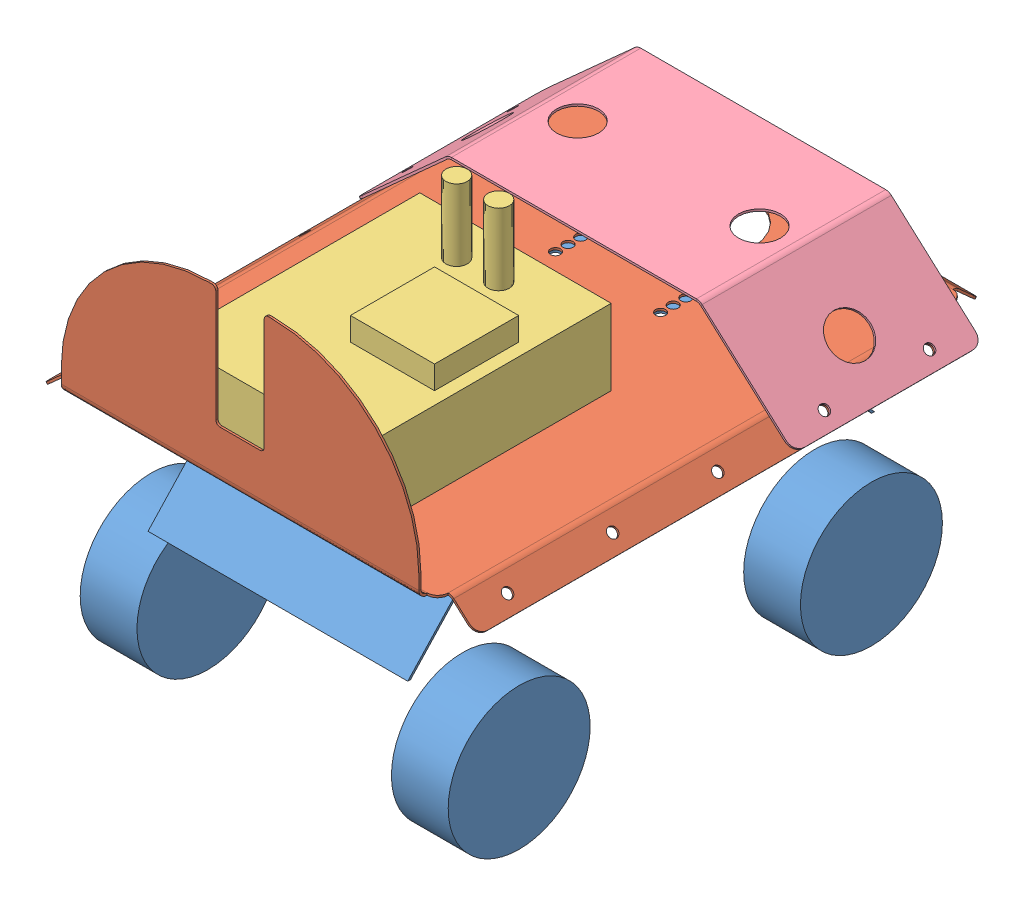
SolidWorks assembly assembly.SLDASM, configuration Valor predeterminado (file format 6000). Lengths in mm.
Overall size (209.32 205 267.75).
4 component instances, 4 part files, 9 mates.
Components (placement in the parent):
- base-1: base.SLDPRT [Valor predeterminado] at (-96.0365 -43.7884 0) size (175 124 235)
- control_unit_suport_-1: control_unit_suport_.SLDPRT [Valor predeterminado] at (-96.0365 81.2116 0) size (207.5 91.74 267.75)
- jetson_nano-1: jetson_nano.SLDPRT [Valor predeterminado] at (-96.0365 81.2116 58) size (91 70 120)
- gps_suport_SLDPRT-1: gps_suport_SLDPRT.SLDPRT [Valor predeterminado] at (-96.2409 111.3291 -75) size (209.32 41.15 90)
Mates (geometry in assembly coordinates):
- Coincidente1: coincident anti-aligned: plane of base-1 through (-96.0365 80.2116 0) normal (0 1 0); plane of control_unit_suport_-1 through (-96.0365 80.2116 0) normal (0 -1 0)
- Concêntrico1: concentric aligned: cylinder of base-1 through (-71.0365 -43.7884 46) axis (0 1 0) radius 2.4; cylinder of control_unit_suport_-1 through (-71.0365 71.2116 46) axis (0 1 0) radius 2.4
- Concêntrico2: concentric aligned: cylinder of base-1 through (-121.0365 -43.7884 46) axis (0 1 0) radius 2.4; cylinder of control_unit_suport_-1 through (-121.0365 71.2116 46) axis (0 1 0) radius 2.4
- Coincidente2: coincident anti-aligned: plane of control_unit_suport_-1 through (-96.0365 81.2116 0) normal (0 1 0); plane of jetson_nano-1 through (-96.0365 81.2116 58) normal (0 -1 0)
- Largura1: width aligned: plane of base-1 through (-8.5365 23.7116 -117.5) normal (1 0 0); plane of base-1 through (-183.5365 23.7116 -117.5) normal (-1 0 0); plane of jetson_nano-1 through (-50.5365 117.2116 -2) normal (1 0 0); plane of jetson_nano-1 through (-141.5365 117.2116 -2) normal (-1 0 0)
- Distância1: distance = 10 mm anti-aligned: plane of control_unit_suport_-1 through (-96.0365 81.2116 128) normal (0 0 -1); plane of jetson_nano-1 through (-141.5365 117.2116 118) normal (0 0 1)
- Coincidente4: coincident anti-aligned: plane of control_unit_suport_-1 through (-54.4168 126.156 0) normal (0.669131 0.743145 0); plane of gps_suport_SLDPRT-1 through (-69.5059 139.7422 -75) normal (-0.669131 -0.743145 0)
- Concêntrico4: concentric aligned: cylinder of control_unit_suport_-1 through (-91.0982 -28.3916 -100) axis (0.669131 0.743145 0) radius 2.4; cylinder of gps_suport_SLDPRT-1 through (-91.245 -28.5547 -100) axis (0.669131 0.743145 0) radius 2.4
- Concêntrico5: concentric aligned: cylinder of control_unit_suport_-1 through (-91.0982 -28.3916 -50) axis (0.669131 0.743145 0) radius 2.4; cylinder of gps_suport_SLDPRT-1 through (-91.245 -28.5547 -50) axis (0.669131 0.743145 0) radius 2.4
